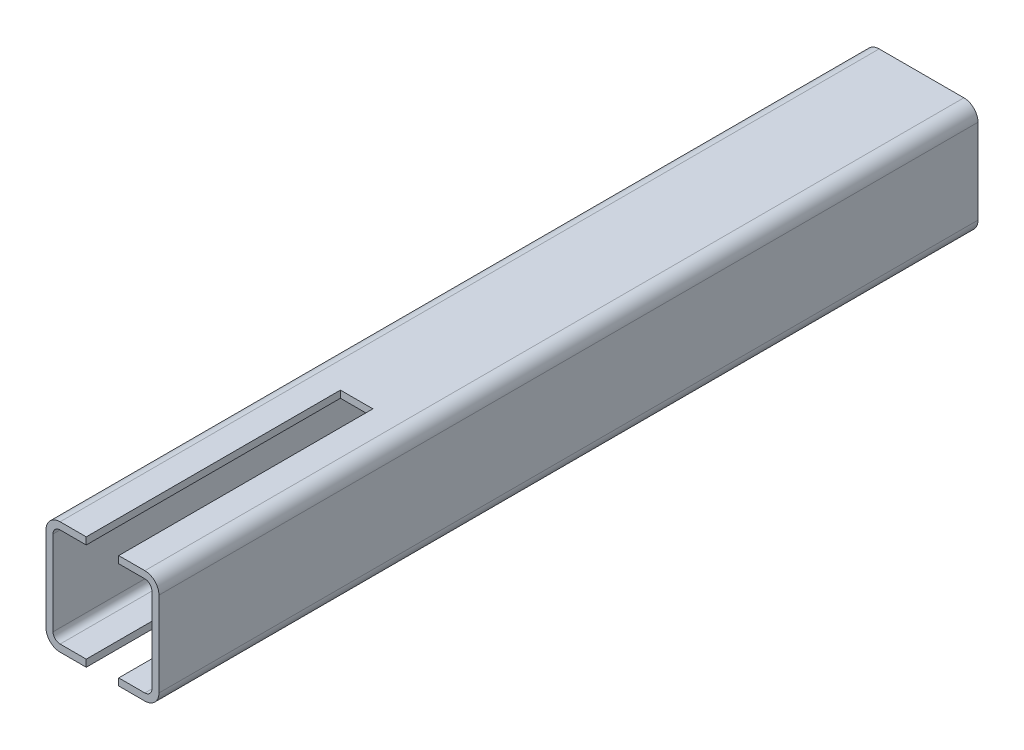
from build123d import *

# Parameters (mm, degrees)
BEAM_6IN_DEPTH      = 152.4
BEAM_6IN_DEPTH_BACK = 1320.8
SKETCH1_W           = 58.42
SKETCH1_H           = 309.795643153
CUT_EXTRUDE1_DEPTH  = 457.2


with BuildPart() as part:
    # 6in beam → Beam 6in (new, two sides: drawn at the far end of the back side and taken through both)
    with BuildSketch(Plane(origin=(0, 0, 0), x_dir=(0, 1, 0), z_dir=(0, 0, 1)).offset(-BEAM_6IN_DEPTH_BACK)):
        with BuildLine():
            Line((-76.2, -101.6), (76.2, -101.6))
            ThreePointArc((76.2, -101.6), (94.160512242, -94.160512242), (101.6, -76.2))
            Line((101.6, -76.2), (101.6, 76.2))
            ThreePointArc((101.6, 76.2), (94.160512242, 94.160512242), (76.2, 101.6))
            Line((76.2, 101.6), (-76.2, 101.6))
            ThreePointArc((-76.2, 101.6), (-94.160512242, 94.160512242), (-101.6, 76.2))
            Line((-101.6, 76.2), (-101.6, -76.2))
            ThreePointArc((-101.6, -76.2), (-94.160512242, -94.160512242), (-76.2, -101.6))
        make_face()
        with BuildLine():
            Line((-76.2, -88.9), (76.2, -88.9))
            ThreePointArc((76.2, -88.9), (85.180256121, -85.180256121), (88.9, -76.2))
            Line((88.9, -76.2), (88.9, 76.2))
            ThreePointArc((88.9, 76.2), (85.180256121, 85.180256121), (76.2, 88.9))
            Line((76.2, 88.9), (-76.2, 88.9))
            ThreePointArc((-76.2, 88.9), (-85.180256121, 85.180256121), (-88.9, 76.2))
            Line((-88.9, 76.2), (-88.9, -76.2))
            ThreePointArc((-88.9, -76.2), (-85.180256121, -85.180256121), (-76.2, -88.9))
        make_face(mode=Mode.SUBTRACT)
    extrude(amount=BEAM_6IN_DEPTH + BEAM_6IN_DEPTH_BACK)

    # Sketch1 → Cut-Extrude1 (cut)
    with BuildSketch(Plane.XY.offset(152.4)):
        with Locations((0, 5.504216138)):
            Rectangle(SKETCH1_W, SKETCH1_H)
    extrude(amount=-CUT_EXTRUDE1_DEPTH, mode=Mode.SUBTRACT)


solid = part.part
